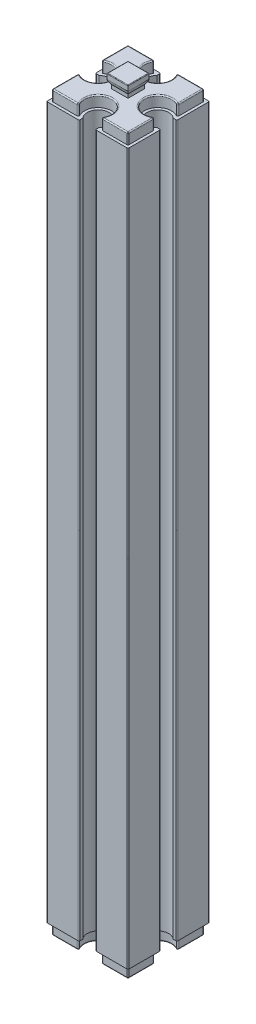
from build123d import *

# Parameters (mm, degrees)
EXTRUDE_1_DEPTH        = 65.5
EXTRUDE_2_DEPTH        = 2
EXTRUDE_3_DEPTH        = 2
FILLET_3_R             = 0.2
CUT_EXTRUDE_1_DEPTH    = 3
FILLET_4_R             = 0.2
FILLET_5_R             = 0.1
FILLET_3_OF_MIRROR_1_R = 0.2
FILLET_4_OF_MIRROR_1_R = 0.2
FILLET_5_OF_MIRROR_1_R = 0.1


with BuildPart() as part:
    # Sketch 1 → Extrude 1 (new body)
    with BuildSketch(Plane(origin=(0, 0, 0), x_dir=(1, 0, 0), z_dir=(0, 1, 0))):
        with BuildLine():
            Line((-7.5, 7.5), (-1.5, 7.5))
            Line((-1.5, 7.5), (-1.5, 6.822875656))
            ThreePointArc((-1.5, 6.822875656), (0, 3.5), (1.5, 6.822875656))
            Line((1.5, 6.822875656), (1.5, 7.5))
            Line((1.5, 7.5), (7.5, 7.5))
            Line((7.5, 7.5), (7.5, 1.5))
            Line((7.5, 1.5), (6.822875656, 1.5))
            ThreePointArc((6.822875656, 1.5), (3.5, 0), (6.822875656, -1.5))
            Line((6.822875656, -1.5), (7.5, -1.5))
            Line((7.5, -1.5), (7.5, -7.5))
            Line((7.5, -7.5), (1.5, -7.5))
            Line((1.5, -7.5), (1.5, -6.822875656))
            ThreePointArc((1.5, -6.822875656), (0, -3.5), (-1.5, -6.822875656))
            Line((-1.5, -6.822875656), (-1.5, -7.5))
            Line((-1.5, -7.5), (-7.5, -7.5))
            Line((-7.5, -7.5), (-7.5, -1.5))
            Line((-7.5, -1.5), (-6.822875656, -1.5))
            ThreePointArc((-6.822875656, -1.5), (-3.5, 0), (-6.822875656, 1.5))
            Line((-6.822875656, 1.5), (-7.5, 1.5))
            Line((-7.5, 1.5), (-7.5, 7.5))
        make_face()
    extrude_1 = extrude(amount=EXTRUDE_1_DEPTH)

    # Sketch 2 → Extrude 2 (add)
    with BuildSketch(Plane(origin=(0, 65.5, 0), x_dir=(1, 0, 0), z_dir=(0, 1, 0))):
        with BuildLine():
            Line((-7, 7), (-7, 2))
            ThreePointArc((-7, 2), (-3, 0), (-7, -2))
            Line((-7, -2), (-7, -7))
            Line((-7, -7), (-2, -7))
            ThreePointArc((-2, -7), (0, -3), (2, -7))
            Line((2, -7), (7, -7))
            Line((7, -7), (7, -2))
            ThreePointArc((7, -2), (3, 0), (7, 2))
            Line((7, 2), (7, 7))
            Line((7, 7), (2, 7))
            ThreePointArc((2, 7), (0, 3), (-2, 7))
            Line((-2, 7), (-7, 7))
        make_face()
    extrude_2 = extrude(amount=EXTRUDE_2_DEPTH)

    # Sketch 3 → Extrude 3 (add, symmetric)
    with BuildSketch(Plane(origin=(0, 0, 0), x_dir=(0, 0, -1), z_dir=(1, 0, 0))):
        with BuildLine():
            Line((-1.5, 67.5), (1.5, 67.5))
            Line((1.5, 67.5), (1.5, 68.177124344))
            ThreePointArc((1.5, 68.177124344), (1.780042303, 68.588161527), (1.95, 69.055590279))
            Line((1.95, 69.055590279), (1.95, 70))
            Line((1.95, 70), (-1.95, 70))
            Line((-1.95, 70), (-1.95, 69.055590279))
            ThreePointArc((-1.95, 69.055590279), (-1.780042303, 68.588161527), (-1.5, 68.177124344))
            Line((-1.5, 68.177124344), (-1.5, 67.5))
        make_face()
    extrude_3 = extrude(amount=EXTRUDE_3_DEPTH, both=True)

    # Fillet 3
    fillet_3_edges = [part.edges().sort_by_distance(p)[0] for p in [
        (-7.5, 32.75, -7.5),
        (-1.5, 32.75, -7.5),
        (1.5, 32.75, -7.5),
        (7.5, 32.75, -7.5),
        (7.5, 32.75, -1.5),
        (7.5, 32.75, 1.5),
        (7.5, 32.75, 7.5),
        (1.5, 32.75, 7.5),
        (-1.5, 32.75, 7.5),
        (-7.5, 32.75, 7.5),
        (-7.5, 32.75, 1.5),
        (-6.822875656, 32.75, -1.5),
        (-7.5, 32.75, -1.5),
    ]]
    fillet(fillet_3_edges, radius=FILLET_3_R)

    # Sketch 4 → Cut-Extrude 1 (cut, symmetric)
    with BuildSketch(Plane.XY):
        with BuildLine():
            Line((1.95, 70), (2, 70))
            Line((2, 70), (2, 67.5))
            Line((2, 67.5), (1.5, 67.5))
            Line((1.5, 67.5), (1.5, 68.177124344))
            ThreePointArc((1.5, 68.177124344), (1.780042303, 68.588161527), (1.95, 69.055590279))
            Line((1.95, 69.055590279), (1.95, 70))
        make_face()
        with BuildLine():
            Line((-1.95, 70), (-1.95, 69.055590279))
            ThreePointArc((-1.95, 69.055590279), (-1.780042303, 68.588161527), (-1.5, 68.177124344))
            Line((-1.5, 68.177124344), (-1.5, 67.5))
            Line((-1.5, 67.5), (-2, 67.5))
            Line((-2, 67.5), (-2, 70))
            Line((-2, 70), (-1.95, 70))
        make_face()
    cut_extrude_1 = extrude(amount=CUT_EXTRUDE_1_DEPTH, both=True, mode=Mode.SUBTRACT)

    # Fillet 4
    fillet_4_edges = [part.edges().sort_by_distance(p)[0] for p in [
        (-2, 66.5, -7),
        (-7, 66.5, -7),
        (-7, 66.5, -2),
        (-7, 66.5, 2),
        (-7, 66.5, 7),
        (-2, 66.5, 7),
        (2, 66.5, 7),
        (7, 66.5, 7),
        (7, 66.5, 2),
        (7, 66.5, -2),
        (7, 66.5, -7),
        (2, 66.5, -7),
        (-4.5, 67.5, -7),
        (-7, 67.5, -4.5),
        (-3, 67.5, 0),
        (-7, 67.5, 4.5),
        (-4.5, 67.5, 7),
        (0, 67.5, 3),
        (4.5, 67.5, 7),
        (7, 67.5, 4.5),
        (3, 67.5, 0),
        (7, 67.5, -4.5),
        (4.5, 67.5, -7),
        (0, 67.5, -3),
    ]]
    fillet(fillet_4_edges, radius=FILLET_4_R)

    # Fillet 5
    fillet_5_edges = [part.edges().sort_by_distance(p)[0] for p in [
        (1.95, 70, 0),
        (0, 70, -1.95),
        (0, 70, 1.95),
        (-1.95, 70, 0),
    ]]
    fillet(fillet_5_edges, radius=FILLET_5_R)


with BuildPart() as mirror_1_1:
    # Mirror 1: Extrude 1, Extrude 2, Extrude 3 across Top Plane
    add(extrude_1.mirror(Plane(origin=(0, 0, 0), x_dir=(1, 0, 0), z_dir=(0, 1, 0))))
    add(extrude_2.mirror(Plane(origin=(0, 0, 0), x_dir=(1, 0, 0), z_dir=(0, 1, 0))))
    add(extrude_3.mirror(Plane(origin=(0, 0, 0), x_dir=(1, 0, 0), z_dir=(0, 1, 0))))

    # Mirror 1 2: Cut-Extrude 1 across Top Plane
    add(cut_extrude_1.mirror(Plane(origin=(0, 0, 0), x_dir=(1, 0, 0), z_dir=(0, 1, 0))), mode=Mode.SUBTRACT)

    # Fillet 3 of Mirror 1
    fillet_3_of_mirror_1_edges = [mirror_1_1.edges().sort_by_distance(p)[0] for p in [
        (-7.5, -32.75, -7.5),
        (-1.5, -32.75, -7.5),
        (1.5, -32.75, -7.5),
        (7.5, -32.75, -7.5),
        (7.5, -32.75, -1.5),
        (7.5, -32.75, 1.5),
        (7.5, -32.75, 7.5),
        (1.5, -32.75, 7.5),
        (-1.5, -32.75, 7.5),
        (-7.5, -32.75, 7.5),
        (-7.5, -32.75, 1.5),
        (-6.822875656, -32.75, -1.5),
        (-7.5, -32.75, -1.5),
    ]]
    fillet(fillet_3_of_mirror_1_edges, radius=FILLET_3_OF_MIRROR_1_R)

    # Fillet 4 of Mirror 1
    fillet_4_of_mirror_1_edges = [mirror_1_1.edges().sort_by_distance(p)[0] for p in [
        (-2, -66.5, -7),
        (-7, -66.5, -7),
        (-7, -66.5, -2),
        (-7, -66.5, 2),
        (-7, -66.5, 7),
        (-2, -66.5, 7),
        (2, -66.5, 7),
        (7, -66.5, 7),
        (7, -66.5, 2),
        (7, -66.5, -2),
        (7, -66.5, -7),
        (2, -66.5, -7),
        (-4.5, -67.5, -7),
        (-7, -67.5, -4.5),
        (-3, -67.5, 0),
        (-7, -67.5, 4.5),
        (-4.5, -67.5, 7),
        (0, -67.5, 3),
        (4.5, -67.5, 7),
        (7, -67.5, 4.5),
        (3, -67.5, 0),
        (7, -67.5, -4.5),
        (4.5, -67.5, -7),
        (0, -67.5, -3),
    ]]
    fillet(fillet_4_of_mirror_1_edges, radius=FILLET_4_OF_MIRROR_1_R)

    # Fillet 5 of Mirror 1
    fillet_5_of_mirror_1_edges = [mirror_1_1.edges().sort_by_distance(p)[0] for p in [
        (1.95, -70, 0),
        (0, -70, -1.95),
        (0, -70, 1.95),
        (-1.95, -70, 0),
    ]]
    fillet(fillet_5_of_mirror_1_edges, radius=FILLET_5_OF_MIRROR_1_R)


with BuildPart() as part_1:
    add(part.part)

    # Mirror 1 united with what the copies tou: union Mirror 1_1
    add(mirror_1_1.part)


solid = part_1.part
